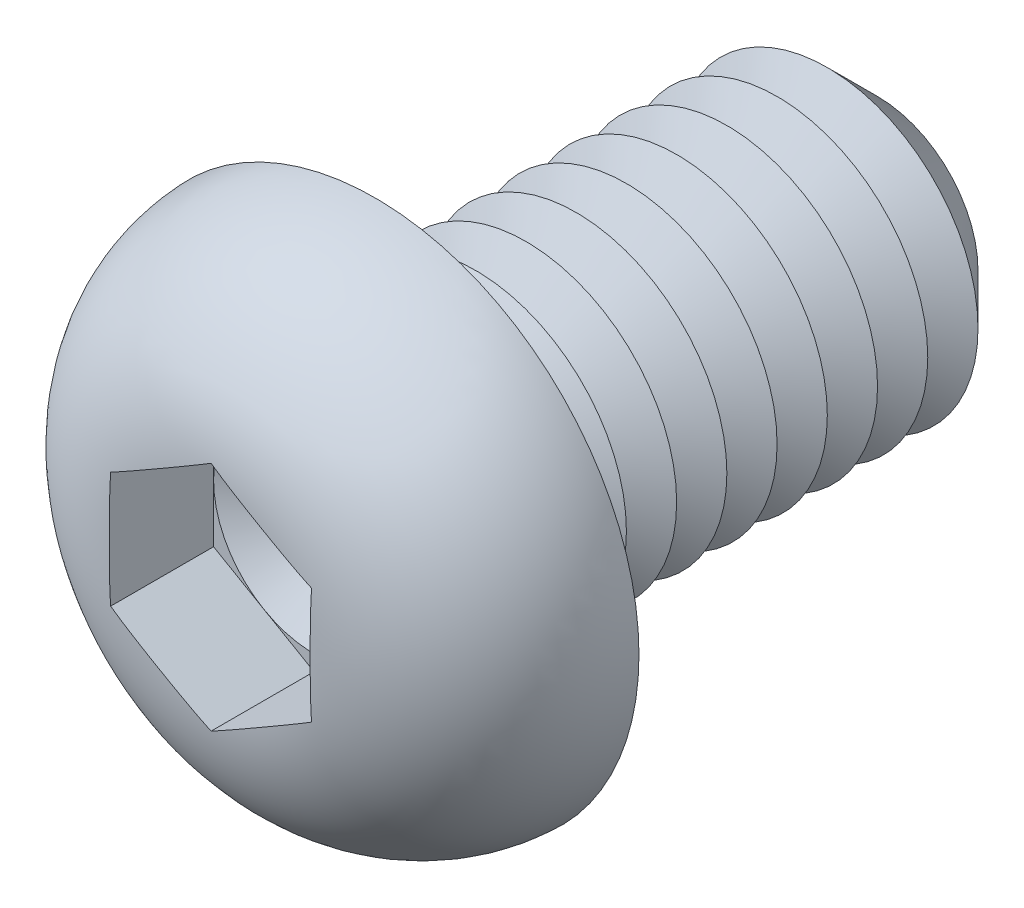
ISO-10303-21;
HEADER;
FILE_DESCRIPTION(('STEP AP214'),'2;1');
FILE_NAME('part.step','',(''),(''),'','','');
FILE_SCHEMA(('AUTOMOTIVE_DESIGN { 1 0 10303 214 1 1 1 1 }'));
ENDSEC;
DATA;
#1=APPLICATION_CONTEXT('core data for automotive mechanical design processes');
#2=APPLICATION_PROTOCOL_DEFINITION('international standard','automotive_design',2000,#1);
#3=PRODUCT_CONTEXT('',#1,'mechanical');
#4=PRODUCT('Part','Part','',(#3));
#5=PRODUCT_RELATED_PRODUCT_CATEGORY('part','',(#4));
#6=PRODUCT_DEFINITION_FORMATION('','',#4);
#7=PRODUCT_DEFINITION_CONTEXT('part definition',#1,'design');
#8=PRODUCT_DEFINITION('design','',#6,#7);
#9=PRODUCT_DEFINITION_SHAPE('','',#8);
#10=(LENGTH_UNIT() NAMED_UNIT(*) SI_UNIT(.MILLI.,.METRE.));
#11=(NAMED_UNIT(*) PLANE_ANGLE_UNIT() SI_UNIT($,.RADIAN.));
#12=(NAMED_UNIT(*) SI_UNIT($,.STERADIAN.) SOLID_ANGLE_UNIT());
#13=UNCERTAINTY_MEASURE_WITH_UNIT(LENGTH_MEASURE(1.E-05),#10,'distance_accuracy_value','');
#14=(GEOMETRIC_REPRESENTATION_CONTEXT(3) GLOBAL_UNCERTAINTY_ASSIGNED_CONTEXT((#13)) GLOBAL_UNIT_ASSIGNED_CONTEXT((#10,
#11,#12)) REPRESENTATION_CONTEXT('',''));
#15=CARTESIAN_POINT('',(0.,0.,0.));
#16=DIRECTION('',(0.,0.,1.));
#17=DIRECTION('',(1.,0.,0.));
#18=AXIS2_PLACEMENT_3D('',#15,#16,#17);
#19=CARTESIAN_POINT('',(0.,0.,1.22));
#20=DIRECTION('',(0.,0.,1.));
#21=DIRECTION('',(1.,0.,0.));
#22=AXIS2_PLACEMENT_3D('',#19,#20,#21);
#23=PLANE('',#22);
#24=CARTESIAN_POINT('',(0.,0.,1.22));
#25=DIRECTION('',(0.,0.,1.));
#26=DIRECTION('',(1.,0.,0.));
#27=AXIS2_PLACEMENT_3D('',#24,#25,#26);
#28=CIRCLE('',#27,2.);
#29=CARTESIAN_POINT('',(2.,0.,1.22));
#30=VERTEX_POINT('',#29);
#31=CARTESIAN_POINT('',(1.,1.73205080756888,1.22));
#32=VERTEX_POINT('',#31);
#33=EDGE_CURVE('E117',#30,#32,#28,.T.);
#34=ORIENTED_EDGE('',*,*,#33,.F.);
#35=DIRECTION('',(0.,1.,0.));
#36=VECTOR('',#35,1.);
#37=CARTESIAN_POINT('',(2.,-1.15470053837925,1.22));
#38=LINE('',#37,#36);
#39=CARTESIAN_POINT('',(2.,1.15470053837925,1.22));
#40=VERTEX_POINT('',#39);
#41=EDGE_CURVE('E140',#30,#40,#38,.T.);
#42=ORIENTED_EDGE('',*,*,#41,.T.);
#43=DIRECTION('',(-0.866025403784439,0.5,0.));
#44=VECTOR('',#43,1.);
#45=CARTESIAN_POINT('',(2.,1.15470053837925,1.22));
#46=LINE('',#45,#44);
#47=EDGE_CURVE('E136',#40,#32,#46,.T.);
#48=ORIENTED_EDGE('',*,*,#47,.T.);
#49=EDGE_LOOP('',(#34,#42,#48));
#50=FACE_BOUND('',#49,.T.);
#51=ADVANCED_FACE('F39',(#50),#23,.T.);
#52=CARTESIAN_POINT('',(0.,0.,1.22));
#53=DIRECTION('',(0.,0.,1.));
#54=DIRECTION('',(1.,0.,0.));
#55=AXIS2_PLACEMENT_3D('',#52,#53,#54);
#56=CIRCLE('',#55,2.);
#57=CARTESIAN_POINT('',(-1.,1.73205080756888,1.22));
#58=VERTEX_POINT('',#57);
#59=EDGE_CURVE('E11',#32,#58,#56,.T.);
#60=ORIENTED_EDGE('',*,*,#59,.F.);
#61=CARTESIAN_POINT('',(0.,2.3094010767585,1.22));
#62=VERTEX_POINT('',#61);
#63=EDGE_CURVE('E130',#32,#62,#46,.T.);
#64=ORIENTED_EDGE('',*,*,#63,.T.);
#65=DIRECTION('',(-0.866025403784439,-0.5,0.));
#66=VECTOR('',#65,1.);
#67=CARTESIAN_POINT('',(0.,2.3094010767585,1.22));
#68=LINE('',#67,#66);
#69=EDGE_CURVE('E131',#62,#58,#68,.T.);
#70=ORIENTED_EDGE('',*,*,#69,.T.);
#71=EDGE_LOOP('',(#60,#64,#70));
#72=FACE_BOUND('',#71,.T.);
#73=ADVANCED_FACE('F129',(#72),#23,.T.);
#74=CARTESIAN_POINT('',(-2.,0.,1.22));
#75=VERTEX_POINT('',#74);
#76=EDGE_CURVE('E49',#58,#75,#56,.T.);
#77=ORIENTED_EDGE('',*,*,#76,.F.);
#78=CARTESIAN_POINT('',(-2.,1.15470053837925,1.22));
#79=VERTEX_POINT('',#78);
#80=EDGE_CURVE('E143',#58,#79,#68,.T.);
#81=ORIENTED_EDGE('',*,*,#80,.T.);
#82=DIRECTION('',(0.,-1.,0.));
#83=VECTOR('',#82,1.);
#84=CARTESIAN_POINT('',(-2.,1.15470053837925,1.22));
#85=LINE('',#84,#83);
#86=EDGE_CURVE('E153',#79,#75,#85,.T.);
#87=ORIENTED_EDGE('',*,*,#86,.T.);
#88=EDGE_LOOP('',(#77,#81,#87));
#89=FACE_BOUND('',#88,.T.);
#90=ADVANCED_FACE('F270',(#89),#23,.T.);
#91=CARTESIAN_POINT('',(-1.,-1.73205080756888,1.22));
#92=VERTEX_POINT('',#91);
#93=EDGE_CURVE('E254',#75,#92,#56,.T.);
#94=ORIENTED_EDGE('',*,*,#93,.F.);
#95=CARTESIAN_POINT('',(-2.,-1.15470053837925,1.22));
#96=VERTEX_POINT('',#95);
#97=EDGE_CURVE('E152',#75,#96,#85,.T.);
#98=ORIENTED_EDGE('',*,*,#97,.T.);
#99=DIRECTION('',(0.866025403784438,-0.5,0.));
#100=VECTOR('',#99,1.);
#101=CARTESIAN_POINT('',(-2.,-1.15470053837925,1.22));
#102=LINE('',#101,#100);
#103=EDGE_CURVE('E158',#96,#92,#102,.T.);
#104=ORIENTED_EDGE('',*,*,#103,.T.);
#105=EDGE_LOOP('',(#94,#98,#104));
#106=FACE_BOUND('',#105,.T.);
#107=ADVANCED_FACE('F265',(#106),#23,.T.);
#108=CARTESIAN_POINT('',(0.999999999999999,-1.73205080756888,1.22));
#109=VERTEX_POINT('',#108);
#110=EDGE_CURVE('E56',#92,#109,#56,.T.);
#111=ORIENTED_EDGE('',*,*,#110,.F.);
#112=CARTESIAN_POINT('',(0.,-2.3094010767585,1.22));
#113=VERTEX_POINT('',#112);
#114=EDGE_CURVE('E157',#92,#113,#102,.T.);
#115=ORIENTED_EDGE('',*,*,#114,.T.);
#116=DIRECTION('',(0.866025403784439,0.5,0.));
#117=VECTOR('',#116,1.);
#118=CARTESIAN_POINT('',(0.,-2.3094010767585,1.22));
#119=LINE('',#118,#117);
#120=EDGE_CURVE('E163',#113,#109,#119,.T.);
#121=ORIENTED_EDGE('',*,*,#120,.T.);
#122=EDGE_LOOP('',(#111,#115,#121));
#123=FACE_BOUND('',#122,.T.);
#124=ADVANCED_FACE('F307',(#123),#23,.T.);
#125=CARTESIAN_POINT('',(0.,0.,-10.));
#126=DIRECTION('',(0.,0.,1.));
#127=DIRECTION('',(1.,0.,0.));
#128=AXIS2_PLACEMENT_3D('',#125,#126,#127);
#129=CYLINDRICAL_SURFACE('',#128,3.);
#130=CARTESIAN_POINT('',(0.,0.,-0.5));
#131=DIRECTION('',(0.,0.,1.));
#132=DIRECTION('',(1.,0.,0.));
#133=AXIS2_PLACEMENT_3D('',#130,#131,#132);
#134=CIRCLE('',#133,3.);
#135=CARTESIAN_POINT('',(3.,0.,-0.5));
#136=VERTEX_POINT('',#135);
#137=EDGE_CURVE('E241',#136,#136,#134,.F.);
#138=ORIENTED_EDGE('',*,*,#137,.T.);
#139=EDGE_LOOP('',(#138));
#140=FACE_BOUND('',#139,.T.);
#141=CARTESIAN_POINT('',(0.,0.,-1.));
#142=DIRECTION('',(0.,0.,1.));
#143=DIRECTION('',(1.,0.,0.));
#144=AXIS2_PLACEMENT_3D('',#141,#142,#143);
#145=CIRCLE('',#144,3.00000000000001);
#146=CARTESIAN_POINT('',(3.00000000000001,0.,-1.));
#147=VERTEX_POINT('',#146);
#148=EDGE_CURVE('E138',#147,#147,#145,.T.);
#149=ORIENTED_EDGE('',*,*,#148,.T.);
#150=EDGE_LOOP('',(#149));
#151=FACE_BOUND('',#150,.T.);
#152=ADVANCED_FACE('F308',(#140,#151),#129,.T.);
#153=CARTESIAN_POINT('',(0.,5.25,0.));
#154=DIRECTION('',(0.,0.,1.));
#155=DIRECTION('',(1.,0.,0.));
#156=AXIS2_PLACEMENT_3D('',#153,#154,#155);
#157=PLANE('',#156);
#158=CARTESIAN_POINT('',(0.,0.,0.));
#159=DIRECTION('',(0.,0.,1.));
#160=DIRECTION('',(1.,0.,0.));
#161=AXIS2_PLACEMENT_3D('',#158,#159,#160);
#162=CIRCLE('',#161,3.5);
#163=CARTESIAN_POINT('',(3.5,0.,0.));
#164=VERTEX_POINT('',#163);
#165=EDGE_CURVE('E244',#164,#164,#162,.T.);
#166=ORIENTED_EDGE('',*,*,#165,.T.);
#167=EDGE_LOOP('',(#166));
#168=FACE_BOUND('',#167,.T.);
#169=CARTESIAN_POINT('',(0.,0.,0.));
#170=DIRECTION('',(0.,0.,1.));
#171=DIRECTION('',(1.,0.,0.));
#172=AXIS2_PLACEMENT_3D('',#169,#170,#171);
#173=CIRCLE('',#172,5.25);
#174=CARTESIAN_POINT('',(5.25,0.,0.));
#175=VERTEX_POINT('',#174);
#176=EDGE_CURVE('E174',#175,#175,#173,.T.);
#177=ORIENTED_EDGE('',*,*,#176,.F.);
#178=EDGE_LOOP('',(#177));
#179=FACE_BOUND('',#178,.T.);
#180=ADVANCED_FACE('F311',(#168,#179),#157,.F.);
#181=CARTESIAN_POINT('',(0.,0.,-0.0999999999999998));
#182=DIRECTION('',(0.,0.,1.));
#183=DIRECTION('',(1.,0.,0.));
#184=AXIS2_PLACEMENT_3D('',#181,#182,#183);
#185=DEGENERATE_TOROIDAL_SURFACE('',#184,1.85147090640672,3.4,.T.);
#186=CARTESIAN_POINT('',(-2.0002,1.15458506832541,3.26900492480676));
#187=CARTESIAN_POINT('',(-1.91694658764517,1.20265144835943,3.27552708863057));
#188=CARTESIAN_POINT('',(-1.83362001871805,1.25076006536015,3.28041849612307));
#189=CARTESIAN_POINT('',(-1.66691146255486,1.34700929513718,3.28784569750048));
#190=CARTESIAN_POINT('',(-1.58352950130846,1.39514989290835,3.29038223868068));
#191=CARTESIAN_POINT('',(-1.4167967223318,1.49141310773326,3.29400753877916));
#192=CARTESIAN_POINT('',(-1.33344591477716,1.5395357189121,3.29509714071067));
#193=CARTESIAN_POINT('',(-1.16673007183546,1.63578915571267,3.29647051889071));
#194=CARTESIAN_POINT('',(-1.08336503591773,1.68391998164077,3.29675420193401));
#195=CARTESIAN_POINT('',(-0.916634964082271,1.78018163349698,3.29675420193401));
#196=CARTESIAN_POINT('',(-0.833269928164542,1.82831245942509,3.29647051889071));
#197=CARTESIAN_POINT('',(-0.666554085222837,1.92456589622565,3.29509714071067));
#198=CARTESIAN_POINT('',(-0.583203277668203,1.9726885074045,3.29400753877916));
#199=CARTESIAN_POINT('',(-0.416470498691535,2.06895172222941,3.29038223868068));
#200=CARTESIAN_POINT('',(-0.333088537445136,2.11709232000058,3.28784569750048));
#201=CARTESIAN_POINT('',(-0.166379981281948,2.21334154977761,3.28041849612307));
#202=CARTESIAN_POINT('',(-0.0830534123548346,2.26145016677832,3.27552708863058));
#203=CARTESIAN_POINT('',(0.000200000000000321,2.30951654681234,3.26900492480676));
#204=B_SPLINE_CURVE_WITH_KNOTS('',3,(#186,#187,#188,#189,#190,#191,#192,#193,#194,#195,#196,
#197,#198,#199,#200,#201,#202,#203),.UNSPECIFIED.,.F.,.F.,(4,2,2,2,2,2,2,2,4),(0.,
0.289010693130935,0.57792963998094,0.866680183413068,1.15546411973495,1.44424805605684,
1.73299859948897,2.02191754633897,2.31092823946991),.UNSPECIFIED.);
#205=CARTESIAN_POINT('',(-2.,1.15470053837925,3.26902062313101));
#206=VERTEX_POINT('',#205);
#207=CARTESIAN_POINT('',(1.70733705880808E-11,2.30940107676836,3.2690206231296));
#208=VERTEX_POINT('',#207);
#209=EDGE_CURVE('E195',#206,#208,#204,.T.);
#210=ORIENTED_EDGE('',*,*,#209,.T.);
#211=CARTESIAN_POINT('',(-0.000199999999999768,2.30951654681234,3.26900492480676));
#212=CARTESIAN_POINT('',(0.0830534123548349,2.26145016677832,3.27552708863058));
#213=CARTESIAN_POINT('',(0.166379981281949,2.21334154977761,3.28041849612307));
#214=CARTESIAN_POINT('',(0.333088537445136,2.11709232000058,3.28784569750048));
#215=CARTESIAN_POINT('',(0.416470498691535,2.06895172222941,3.29038223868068));
#216=CARTESIAN_POINT('',(0.583203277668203,1.9726885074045,3.29400753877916));
#217=CARTESIAN_POINT('',(0.666554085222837,1.92456589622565,3.29509714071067));
#218=CARTESIAN_POINT('',(0.833269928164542,1.82831245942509,3.29647051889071));
#219=CARTESIAN_POINT('',(0.916634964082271,1.78018163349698,3.29675420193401));
#220=CARTESIAN_POINT('',(1.08336503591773,1.68391998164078,3.29675420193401));
#221=CARTESIAN_POINT('',(1.16673007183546,1.63578915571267,3.29647051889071));
#222=CARTESIAN_POINT('',(1.33344591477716,1.5395357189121,3.29509714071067));
#223=CARTESIAN_POINT('',(1.4167967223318,1.49141310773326,3.29400753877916));
#224=CARTESIAN_POINT('',(1.58352950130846,1.39514989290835,3.29038223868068));
#225=CARTESIAN_POINT('',(1.66691146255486,1.34700929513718,3.28784569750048));
#226=CARTESIAN_POINT('',(1.83362001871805,1.25076006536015,3.28041849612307));
#227=CARTESIAN_POINT('',(1.91694658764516,1.20265144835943,3.27552708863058));
#228=CARTESIAN_POINT('',(2.0002,1.15458506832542,3.26900492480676));
#229=B_SPLINE_CURVE_WITH_KNOTS('',3,(#211,#212,#213,#214,#215,#216,#217,#218,#219,#220,#221,
#222,#223,#224,#225,#226,#227,#228),.UNSPECIFIED.,.F.,.F.,(4,2,2,2,2,2,2,2,4),(0.,
0.289010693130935,0.577929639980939,0.866680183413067,1.15546411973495,1.44424805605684,
1.73299859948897,2.02191754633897,2.31092823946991),.UNSPECIFIED.);
#230=CARTESIAN_POINT('',(2.,1.15470053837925,3.26902062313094));
#231=VERTEX_POINT('',#230);
#232=EDGE_CURVE('E224',#208,#231,#229,.T.);
#233=ORIENTED_EDGE('',*,*,#232,.T.);
#234=CARTESIAN_POINT('',(2.,0.,3.29675420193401));
#235=CARTESIAN_POINT('',(2.,-0.0838690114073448,3.29675159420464));
#236=CARTESIAN_POINT('',(2.,-0.167737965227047,3.29653427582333));
#237=CARTESIAN_POINT('',(2.,-0.335473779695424,3.29552217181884));
#238=CARTESIAN_POINT('',(2.,-0.419340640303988,3.29472737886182));
#239=CARTESIAN_POINT('',(2.,-0.587092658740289,3.29218243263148));
#240=CARTESIAN_POINT('',(2.,-0.670977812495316,3.29043194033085));
#241=CARTESIAN_POINT('',(2.,-0.838702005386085,3.28542814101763));
#242=CARTESIAN_POINT('',(2.,-0.922541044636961,3.28217483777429));
#243=CARTESIAN_POINT('',(2.,-1.173343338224,3.26923984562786));
#244=CARTESIAN_POINT('',(2.,-1.34017699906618,3.25638268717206));
#245=CARTESIAN_POINT('',(2.,-1.67225876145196,3.21731215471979));
#246=CARTESIAN_POINT('',(2.,-1.83750825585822,3.19111187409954));
#247=CARTESIAN_POINT('',(2.,-2.10571503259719,3.13417573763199));
#248=CARTESIAN_POINT('',(2.,-2.20973442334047,3.10844622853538));
#249=CARTESIAN_POINT('',(2.,-2.41562153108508,3.04936015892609));
#250=CARTESIAN_POINT('',(2.,-2.51748898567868,3.01600267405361));
#251=CARTESIAN_POINT('',(2.,-2.71832295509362,2.94120377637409));
#252=CARTESIAN_POINT('',(2.,-2.81728700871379,2.89975572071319));
#253=CARTESIAN_POINT('',(2.,-3.01134256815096,2.80859624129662));
#254=CARTESIAN_POINT('',(2.,-3.10643425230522,2.75888519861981));
#255=CARTESIAN_POINT('',(2.,-3.29253530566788,2.65079509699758));
#256=CARTESIAN_POINT('',(2.,-3.38350832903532,2.59235327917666));
#257=CARTESIAN_POINT('',(2.,-3.55964478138,2.46728791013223));
#258=CARTESIAN_POINT('',(2.,-3.64480873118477,2.40066509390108));
#259=CARTESIAN_POINT('',(2.,-3.80840353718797,2.25961603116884));
#260=CARTESIAN_POINT('',(2.,-3.88683504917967,2.18519054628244));
#261=CARTESIAN_POINT('',(2.,-4.03608847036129,2.02906828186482));
#262=CARTESIAN_POINT('',(2.,-4.106911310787,1.94737239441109));
#263=CARTESIAN_POINT('',(2.,-4.23287471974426,1.78665318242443));
#264=CARTESIAN_POINT('',(2.,-4.2888832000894,1.7083085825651));
#265=CARTESIAN_POINT('',(2.,-4.39372062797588,1.54691061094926));
#266=CARTESIAN_POINT('',(2.,-4.44254705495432,1.46385560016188));
#267=CARTESIAN_POINT('',(2.,-4.53249771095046,1.29375158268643));
#268=CARTESIAN_POINT('',(2.,-4.57362814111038,1.20670586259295));
#269=CARTESIAN_POINT('',(2.,-4.6478549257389,1.02924414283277));
#270=CARTESIAN_POINT('',(2.,-4.68094842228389,0.938826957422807));
#271=CARTESIAN_POINT('',(2.,-4.76413649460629,0.674747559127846));
#272=CARTESIAN_POINT('',(2.,-4.80368573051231,0.497625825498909));
#273=CARTESIAN_POINT('',(2.,-4.85179982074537,0.13932226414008));
#274=CARTESIAN_POINT('',(2.,-4.86036774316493,-0.0418591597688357));
#275=CARTESIAN_POINT('',(2.,-4.84642577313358,-0.399473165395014));
#276=CARTESIAN_POINT('',(2.,-4.82452156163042,-0.575929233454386));
#277=CARTESIAN_POINT('',(2.,-4.75142809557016,-0.922615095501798));
#278=CARTESIAN_POINT('',(2.,-4.70024536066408,-1.09284626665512));
#279=CARTESIAN_POINT('',(2.,-4.57020203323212,-1.42258491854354));
#280=CARTESIAN_POINT('',(2.,-4.49131097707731,-1.58208036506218));
#281=CARTESIAN_POINT('',(2.,-4.3083542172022,-1.8860021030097));
#282=CARTESIAN_POINT('',(2.,-4.2042742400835,-2.03041978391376));
#283=CARTESIAN_POINT('',(2.,-3.97174533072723,-2.30354399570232));
#284=CARTESIAN_POINT('',(2.,-3.84281347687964,-2.43183812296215));
#285=CARTESIAN_POINT('',(2.,-3.56631740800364,-2.66612298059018));
#286=CARTESIAN_POINT('',(2.,-3.41877418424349,-2.77213848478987));
#287=CARTESIAN_POINT('',(2.,-3.18261597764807,-2.91604941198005));
#288=CARTESIAN_POINT('',(2.,-3.09905663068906,-2.96247915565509));
#289=CARTESIAN_POINT('',(2.,-2.92856838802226,-3.04879370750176));
#290=CARTESIAN_POINT('',(2.,-2.84163827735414,-3.08867612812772));
#291=CARTESIAN_POINT('',(2.,-2.66495003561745,-3.16199567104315));
#292=CARTESIAN_POINT('',(2.,-2.57518752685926,-3.19542218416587));
#293=CARTESIAN_POINT('',(2.,-2.3936698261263,-3.25594506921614));
#294=CARTESIAN_POINT('',(2.,-2.30191676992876,-3.28304789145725));
#295=CARTESIAN_POINT('',(2.,-2.07265810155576,-3.34285611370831));
#296=CARTESIAN_POINT('',(2.,-1.93423373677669,-3.37205334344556));
#297=CARTESIAN_POINT('',(2.,-1.65546420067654,-3.419280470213));
#298=CARTESIAN_POINT('',(2.,-1.51511762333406,-3.43730169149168));
#299=CARTESIAN_POINT('',(2.,-1.23291689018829,-3.46473877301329));
#300=CARTESIAN_POINT('',(2.,-1.09105869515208,-3.47411015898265));
#301=CARTESIAN_POINT('',(2.,-0.807138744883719,-3.48717303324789));
#302=CARTESIAN_POINT('',(2.,-0.665077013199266,-3.4908651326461));
#303=CARTESIAN_POINT('',(2.,-0.451303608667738,-3.49429675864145));
#304=CARTESIAN_POINT('',(2.,-0.379602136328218,-3.49508825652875));
#305=CARTESIAN_POINT('',(2.,-0.236195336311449,-3.49619580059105));
#306=CARTESIAN_POINT('',(2.,-0.164490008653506,-3.49651184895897));
#307=CARTESIAN_POINT('',(2.,-0.0210718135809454,-3.49680708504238));
#308=CARTESIAN_POINT('',(2.,0.0506410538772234,-3.49678623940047));
#309=CARTESIAN_POINT('',(2.,0.194065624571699,-3.49639104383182));
#310=CARTESIAN_POINT('',(2.,0.265777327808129,-3.49601669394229));
#311=CARTESIAN_POINT('',(2.,0.480501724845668,-3.4941697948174));
#312=CARTESIAN_POINT('',(2.,0.623510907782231,-3.49197539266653));
#313=CARTESIAN_POINT('',(2.,0.909378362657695,-3.48318258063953));
#314=CARTESIAN_POINT('',(2.,1.05223667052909,-3.47658576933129));
#315=CARTESIAN_POINT('',(2.,1.30726724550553,-3.45800282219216));
#316=CARTESIAN_POINT('',(2.,1.41953767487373,-3.44745204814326));
#317=CARTESIAN_POINT('',(2.,1.64336701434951,-3.42020385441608));
#318=CARTESIAN_POINT('',(2.,1.75492585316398,-3.40350582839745));
#319=CARTESIAN_POINT('',(2.,1.97590795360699,-3.36293007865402));
#320=CARTESIAN_POINT('',(2.,2.08534088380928,-3.33910600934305));
#321=CARTESIAN_POINT('',(2.,2.30216001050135,-3.28336687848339));
#322=CARTESIAN_POINT('',(2.,2.40954602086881,-3.25145108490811));
#323=CARTESIAN_POINT('',(2.,2.62289868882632,-3.1784271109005));
#324=CARTESIAN_POINT('',(2.,2.72882262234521,-3.13719314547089));
#325=CARTESIAN_POINT('',(2.,2.93660837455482,-3.04548652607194));
#326=CARTESIAN_POINT('',(2.,3.03847031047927,-2.99501413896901));
#327=CARTESIAN_POINT('',(2.,3.23738754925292,-2.88459171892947));
#328=CARTESIAN_POINT('',(2.,3.33442546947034,-2.82461027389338));
#329=CARTESIAN_POINT('',(2.,3.52225616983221,-2.69545434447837));
#330=CARTESIAN_POINT('',(2.,3.61304636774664,-2.62627609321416));
#331=CARTESIAN_POINT('',(2.,3.77958578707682,-2.48563135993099));
#332=CARTESIAN_POINT('',(2.,3.85595570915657,-2.41489922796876));
#333=CARTESIAN_POINT('',(2.,4.00175744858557,-2.26661746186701));
#334=CARTESIAN_POINT('',(2.,4.07118992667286,-2.18906847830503));
#335=CARTESIAN_POINT('',(2.,4.20228235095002,-2.02784942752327));
#336=CARTESIAN_POINT('',(2.,4.26395450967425,-1.94418931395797));
#337=CARTESIAN_POINT('',(2.,4.37897455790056,-1.7713710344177));
#338=CARTESIAN_POINT('',(2.,4.43232318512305,-1.68221335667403));
#339=CARTESIAN_POINT('',(2.,4.5685109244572,-1.42722170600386));
#340=CARTESIAN_POINT('',(2.,4.64167742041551,-1.25607726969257));
#341=CARTESIAN_POINT('',(2.,4.75695354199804,-0.903699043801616));
#342=CARTESIAN_POINT('',(2.,4.79906366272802,-0.722465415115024));
#343=CARTESIAN_POINT('',(2.,4.84982785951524,-0.362243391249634));
#344=CARTESIAN_POINT('',(2.,4.85966759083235,-0.183422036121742));
#345=CARTESIAN_POINT('',(2.,4.84889099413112,0.17327689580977));
#346=CARTESIAN_POINT('',(2.,4.82827907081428,0.351154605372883));
#347=CARTESIAN_POINT('',(2.,4.75760776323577,0.699332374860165));
#348=CARTESIAN_POINT('',(2.,4.70780624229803,0.869684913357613));
#349=CARTESIAN_POINT('',(2.,4.58058971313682,1.199716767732));
#350=CARTESIAN_POINT('',(2.,4.50317623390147,1.35939667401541));
#351=CARTESIAN_POINT('',(2.,4.32230037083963,1.66542907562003));
#352=CARTESIAN_POINT('',(2.,4.21858077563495,1.81162931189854));
#353=CARTESIAN_POINT('',(2.,3.98879583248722,2.08527000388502));
#354=CARTESIAN_POINT('',(2.,3.86272429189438,2.21270524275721));
#355=CARTESIAN_POINT('',(2.,3.58743550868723,2.45020985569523));
#356=CARTESIAN_POINT('',(2.,3.43756474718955,2.55951924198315));
#357=CARTESIAN_POINT('',(2.,3.12282273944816,2.7535430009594));
#358=CARTESIAN_POINT('',(2.,2.95795742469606,2.83826704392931));
#359=CARTESIAN_POINT('',(2.,2.67096435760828,2.96064273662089));
#360=CARTESIAN_POINT('',(2.,2.55150855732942,3.00473766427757));
#361=CARTESIAN_POINT('',(2.,2.30905936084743,3.08191633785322));
#362=CARTESIAN_POINT('',(2.,2.18606487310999,3.11499664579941));
#363=CARTESIAN_POINT('',(2.,1.93761764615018,3.17114962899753));
#364=CARTESIAN_POINT('',(2.,1.8121607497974,3.19420352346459));
#365=CARTESIAN_POINT('',(2.,1.56000755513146,3.23170431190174));
#366=CARTESIAN_POINT('',(2.,1.43331126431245,3.24615125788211));
#367=CARTESIAN_POINT('',(2.,1.19785080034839,3.26676473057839));
#368=CARTESIAN_POINT('',(2.,1.08915974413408,3.27383022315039));
#369=CARTESIAN_POINT('',(2.,0.87159878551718,3.28448481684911));
#370=CARTESIAN_POINT('',(2.,0.762728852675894,3.28807324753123));
#371=CARTESIAN_POINT('',(2.,0.54488171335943,3.29312180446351));
#372=CARTESIAN_POINT('',(2.,0.435904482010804,3.29458062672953));
#373=CARTESIAN_POINT('',(2.,0.217951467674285,3.29639847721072));
#374=CARTESIAN_POINT('',(2.,0.108975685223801,3.29675759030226));
#375=CARTESIAN_POINT('',(2.,0.,3.29675420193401));
#376=B_SPLINE_CURVE_WITH_KNOTS('',3,(#234,#235,#236,#237,#238,#239,#240,#241,#242,#243,#244,
#245,#246,#247,#248,#249,#250,#251,#252,#253,#254,#255,#256,#257,#258,#259,#260,#261,#262,#263,
#264,#265,#266,#267,#268,#269,#270,#271,#272,#273,#274,#275,#276,#277,#278,#279,#280,#281,#282,
#283,#284,#285,#286,#287,#288,#289,#290,#291,#292,#293,#294,#295,#296,#297,#298,#299,#300,#301,
#302,#303,#304,#305,#306,#307,#308,#309,#310,#311,#312,#313,#314,#315,#316,#317,#318,#319,#320,
#321,#322,#323,#324,#325,#326,#327,#328,#329,#330,#331,#332,#333,#334,#335,#336,#337,#338,#339,
#340,#341,#342,#343,#344,#345,#346,#347,#348,#349,#350,#351,#352,#353,#354,#355,#356,#357,#358,
#359,#360,#361,#362,#363,#364,#365,#366,#367,#368,#369,#370,#371,#372,#373,#374,#375),
.UNSPECIFIED.,.T.,.F.,(4,2,2,2,2,2,2,2,2,2,2,2,2,2,2,2,2,2,2,2,2,2,2,2,2,2,2,2,2,2,2,2,2,2,2,2,
2,2,2,2,2,2,2,2,2,2,2,2,2,2,2,2,2,2,2,2,2,2,2,2,2,2,2,2,2,2,2,2,2,2,4),(0.,0.251606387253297,
0.503215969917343,0.754914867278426,1.00661313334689,1.50825543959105,2.00940643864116,
2.33061510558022,2.65186271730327,2.97337521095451,3.29487288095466,3.61880390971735,
3.94270585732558,4.26657621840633,4.59040689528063,4.8789527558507,5.16759964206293,
5.45601293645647,5.74452864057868,6.28608750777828,6.82759274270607,7.35848716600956,
7.8892634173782,8.42062506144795,8.95228851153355,9.49557283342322,10.0382497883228,
10.3247866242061,10.6114277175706,10.8985359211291,11.1853499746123,11.6091713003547,
12.0333212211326,12.4596400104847,12.8859129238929,13.1010304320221,13.316146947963,
13.5312847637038,13.746422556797,14.1754765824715,14.6043748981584,14.9425387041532,
15.2807358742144,15.6164481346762,15.9521907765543,16.2927694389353,16.6333382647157,
16.9750565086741,17.3169151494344,17.6287548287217,17.9405647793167,18.2518777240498,
18.5631630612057,19.1185081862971,19.6738444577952,20.20853386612,20.7431459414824,
21.2731049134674,21.8030345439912,22.3383600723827,22.8738341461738,23.4279697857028,
23.9818871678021,24.3633752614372,24.7449823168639,25.1273011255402,25.5096176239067,
25.8363061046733,26.163057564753,26.4900090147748,26.8169352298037),.UNSPECIFIED.);
#377=CARTESIAN_POINT('',(2.,-1.15470053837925,3.26902062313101));
#378=VERTEX_POINT('',#377);
#379=EDGE_CURVE('E233',#231,#378,#376,.T.);
#380=ORIENTED_EDGE('',*,*,#379,.T.);
#381=CARTESIAN_POINT('',(2.0002,-1.15458506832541,3.26900492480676));
#382=CARTESIAN_POINT('',(1.91694658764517,-1.20265144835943,3.27552708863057));
#383=CARTESIAN_POINT('',(1.83362001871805,-1.25076006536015,3.28041849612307));
#384=CARTESIAN_POINT('',(1.66691146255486,-1.34700929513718,3.28784569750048));
#385=CARTESIAN_POINT('',(1.58352950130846,-1.39514989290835,3.29038223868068));
#386=CARTESIAN_POINT('',(1.4167967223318,-1.49141310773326,3.29400753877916));
#387=CARTESIAN_POINT('',(1.33344591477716,-1.5395357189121,3.29509714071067));
#388=CARTESIAN_POINT('',(1.16673007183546,-1.63578915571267,3.29647051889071));
#389=CARTESIAN_POINT('',(1.08336503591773,-1.68391998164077,3.29675420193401));
#390=CARTESIAN_POINT('',(0.916634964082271,-1.78018163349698,3.29675420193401));
#391=CARTESIAN_POINT('',(0.833269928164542,-1.82831245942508,3.29647051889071));
#392=CARTESIAN_POINT('',(0.666554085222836,-1.92456589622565,3.29509714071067));
#393=CARTESIAN_POINT('',(0.583203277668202,-1.97268850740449,3.29400753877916));
#394=CARTESIAN_POINT('',(0.416470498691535,-2.06895172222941,3.29038223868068));
#395=CARTESIAN_POINT('',(0.333088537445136,-2.11709232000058,3.28784569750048));
#396=CARTESIAN_POINT('',(0.166379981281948,-2.2133415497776,3.28041849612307));
#397=CARTESIAN_POINT('',(0.0830534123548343,-2.26145016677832,3.27552708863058));
#398=CARTESIAN_POINT('',(-0.000200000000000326,-2.30951654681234,3.26900492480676));
#399=B_SPLINE_CURVE_WITH_KNOTS('',3,(#381,#382,#383,#384,#385,#386,#387,#388,#389,#390,#391,
#392,#393,#394,#395,#396,#397,#398),.UNSPECIFIED.,.F.,.F.,(4,2,2,2,2,2,2,2,4),(0.,
0.289010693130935,0.57792963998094,0.866680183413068,1.15546411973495,1.44424805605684,
1.73299859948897,2.02191754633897,2.31092823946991),.UNSPECIFIED.);
#400=CARTESIAN_POINT('',(0.,-2.3094010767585,3.26902062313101));
#401=VERTEX_POINT('',#400);
#402=EDGE_CURVE('E281',#378,#401,#399,.T.);
#403=ORIENTED_EDGE('',*,*,#402,.T.);
#404=CARTESIAN_POINT('',(0.000199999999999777,-2.30951654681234,3.26900492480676));
#405=CARTESIAN_POINT('',(-0.083053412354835,-2.26145016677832,3.27552708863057));
#406=CARTESIAN_POINT('',(-0.166379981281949,-2.21334154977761,3.28041849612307));
#407=CARTESIAN_POINT('',(-0.333088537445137,-2.11709232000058,3.28784569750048));
#408=CARTESIAN_POINT('',(-0.416470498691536,-2.06895172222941,3.29038223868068));
#409=CARTESIAN_POINT('',(-0.583203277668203,-1.97268850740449,3.29400753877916));
#410=CARTESIAN_POINT('',(-0.666554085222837,-1.92456589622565,3.29509714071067));
#411=CARTESIAN_POINT('',(-0.833269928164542,-1.82831245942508,3.29647051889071));
#412=CARTESIAN_POINT('',(-0.916634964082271,-1.78018163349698,3.29675420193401));
#413=CARTESIAN_POINT('',(-1.08336503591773,-1.68391998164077,3.29675420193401));
#414=CARTESIAN_POINT('',(-1.16673007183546,-1.63578915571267,3.29647051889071));
#415=CARTESIAN_POINT('',(-1.33344591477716,-1.5395357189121,3.29509714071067));
#416=CARTESIAN_POINT('',(-1.4167967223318,-1.49141310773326,3.29400753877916));
#417=CARTESIAN_POINT('',(-1.58352950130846,-1.39514989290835,3.29038223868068));
#418=CARTESIAN_POINT('',(-1.66691146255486,-1.34700929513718,3.28784569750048));
#419=CARTESIAN_POINT('',(-1.83362001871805,-1.25076006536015,3.28041849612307));
#420=CARTESIAN_POINT('',(-1.91694658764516,-1.20265144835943,3.27552708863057));
#421=CARTESIAN_POINT('',(-2.0002,-1.15458506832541,3.26900492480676));
#422=B_SPLINE_CURVE_WITH_KNOTS('',3,(#404,#405,#406,#407,#408,#409,#410,#411,#412,#413,#414,
#415,#416,#417,#418,#419,#420,#421),.UNSPECIFIED.,.F.,.F.,(4,2,2,2,2,2,2,2,4),(0.,
0.289010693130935,0.577929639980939,0.866680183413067,1.15546411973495,1.44424805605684,
1.73299859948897,2.02191754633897,2.31092823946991),.UNSPECIFIED.);
#423=CARTESIAN_POINT('',(-2.,-1.15470053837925,3.26902062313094));
#424=VERTEX_POINT('',#423);
#425=EDGE_CURVE('E277',#401,#424,#422,.T.);
#426=ORIENTED_EDGE('',*,*,#425,.T.);
#427=CARTESIAN_POINT('',(-2.,0.,3.29675420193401));
#428=CARTESIAN_POINT('',(-2.,0.0838690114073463,3.29675159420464));
#429=CARTESIAN_POINT('',(-2.,0.167737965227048,3.29653427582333));
#430=CARTESIAN_POINT('',(-2.,0.335473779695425,3.29552217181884));
#431=CARTESIAN_POINT('',(-2.,0.41934064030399,3.29472737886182));
#432=CARTESIAN_POINT('',(-2.,0.58709265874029,3.29218243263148));
#433=CARTESIAN_POINT('',(-2.,0.670977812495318,3.29043194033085));
#434=CARTESIAN_POINT('',(-2.,0.838702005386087,3.28542814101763));
#435=CARTESIAN_POINT('',(-2.,0.922541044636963,3.28217483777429));
#436=CARTESIAN_POINT('',(-2.,1.173343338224,3.26923984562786));
#437=CARTESIAN_POINT('',(-2.,1.34017699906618,3.25638268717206));
#438=CARTESIAN_POINT('',(-2.,1.67225876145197,3.21731215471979));
#439=CARTESIAN_POINT('',(-2.,1.83750825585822,3.19111187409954));
#440=CARTESIAN_POINT('',(-2.,2.10571503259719,3.13417573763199));
#441=CARTESIAN_POINT('',(-2.,2.20973442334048,3.10844622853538));
#442=CARTESIAN_POINT('',(-2.,2.41562153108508,3.04936015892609));
#443=CARTESIAN_POINT('',(-2.,2.51748898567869,3.01600267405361));
#444=CARTESIAN_POINT('',(-2.,2.71832295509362,2.94120377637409));
#445=CARTESIAN_POINT('',(-2.,2.81728700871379,2.89975572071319));
#446=CARTESIAN_POINT('',(-2.,3.01134256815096,2.80859624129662));
#447=CARTESIAN_POINT('',(-2.,3.10643425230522,2.75888519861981));
#448=CARTESIAN_POINT('',(-2.,3.29253530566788,2.65079509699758));
#449=CARTESIAN_POINT('',(-2.,3.38350832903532,2.59235327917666));
#450=CARTESIAN_POINT('',(-2.,3.55964478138,2.46728791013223));
#451=CARTESIAN_POINT('',(-2.,3.64480873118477,2.40066509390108));
#452=CARTESIAN_POINT('',(-2.,3.80840353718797,2.25961603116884));
#453=CARTESIAN_POINT('',(-2.,3.88683504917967,2.18519054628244));
#454=CARTESIAN_POINT('',(-2.,4.03608847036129,2.02906828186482));
#455=CARTESIAN_POINT('',(-2.,4.106911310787,1.94737239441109));
#456=CARTESIAN_POINT('',(-2.,4.23287471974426,1.78665318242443));
#457=CARTESIAN_POINT('',(-2.,4.2888832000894,1.7083085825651));
#458=CARTESIAN_POINT('',(-2.,4.39372062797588,1.54691061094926));
#459=CARTESIAN_POINT('',(-2.,4.44254705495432,1.46385560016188));
#460=CARTESIAN_POINT('',(-2.,4.53249771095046,1.29375158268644));
#461=CARTESIAN_POINT('',(-2.,4.57362814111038,1.20670586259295));
#462=CARTESIAN_POINT('',(-2.,4.6478549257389,1.02924414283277));
#463=CARTESIAN_POINT('',(-2.,4.68094842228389,0.938826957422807));
#464=CARTESIAN_POINT('',(-2.,4.76413649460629,0.674747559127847));
#465=CARTESIAN_POINT('',(-2.,4.80368573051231,0.497625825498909));
#466=CARTESIAN_POINT('',(-2.,4.85179982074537,0.13932226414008));
#467=CARTESIAN_POINT('',(-2.,4.86036774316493,-0.0418591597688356));
#468=CARTESIAN_POINT('',(-2.,4.84642577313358,-0.399473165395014));
#469=CARTESIAN_POINT('',(-2.,4.82452156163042,-0.575929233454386));
#470=CARTESIAN_POINT('',(-2.,4.75142809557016,-0.922615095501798));
#471=CARTESIAN_POINT('',(-2.,4.70024536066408,-1.09284626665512));
#472=CARTESIAN_POINT('',(-2.,4.57020203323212,-1.42258491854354));
#473=CARTESIAN_POINT('',(-2.,4.49131097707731,-1.58208036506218));
#474=CARTESIAN_POINT('',(-2.,4.3083542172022,-1.8860021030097));
#475=CARTESIAN_POINT('',(-2.,4.2042742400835,-2.03041978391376));
#476=CARTESIAN_POINT('',(-2.,3.97174533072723,-2.30354399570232));
#477=CARTESIAN_POINT('',(-2.,3.84281347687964,-2.43183812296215));
#478=CARTESIAN_POINT('',(-2.,3.56631740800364,-2.66612298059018));
#479=CARTESIAN_POINT('',(-2.,3.41877418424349,-2.77213848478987));
#480=CARTESIAN_POINT('',(-2.,3.18261597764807,-2.91604941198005));
#481=CARTESIAN_POINT('',(-2.,3.09905663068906,-2.96247915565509));
#482=CARTESIAN_POINT('',(-2.,2.92856838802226,-3.04879370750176));
#483=CARTESIAN_POINT('',(-2.,2.84163827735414,-3.08867612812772));
#484=CARTESIAN_POINT('',(-2.,2.66495003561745,-3.16199567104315));
#485=CARTESIAN_POINT('',(-2.,2.57518752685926,-3.19542218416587));
#486=CARTESIAN_POINT('',(-2.,2.3936698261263,-3.25594506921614));
#487=CARTESIAN_POINT('',(-2.,2.30191676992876,-3.28304789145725));
#488=CARTESIAN_POINT('',(-2.,2.07265810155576,-3.34285611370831));
#489=CARTESIAN_POINT('',(-2.,1.93423373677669,-3.37205334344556));
#490=CARTESIAN_POINT('',(-2.,1.65546420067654,-3.419280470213));
#491=CARTESIAN_POINT('',(-2.,1.51511762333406,-3.43730169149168));
#492=CARTESIAN_POINT('',(-2.,1.23291689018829,-3.46473877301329));
#493=CARTESIAN_POINT('',(-2.,1.09105869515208,-3.47411015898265));
#494=CARTESIAN_POINT('',(-2.,0.807138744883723,-3.48717303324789));
#495=CARTESIAN_POINT('',(-2.,0.66507701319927,-3.4908651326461));
#496=CARTESIAN_POINT('',(-2.,0.451303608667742,-3.49429675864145));
#497=CARTESIAN_POINT('',(-2.,0.379602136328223,-3.49508825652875));
#498=CARTESIAN_POINT('',(-2.,0.236195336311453,-3.49619580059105));
#499=CARTESIAN_POINT('',(-2.,0.16449000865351,-3.49651184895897));
#500=CARTESIAN_POINT('',(-2.,0.0210718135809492,-3.49680708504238));
#501=CARTESIAN_POINT('',(-2.,-0.0506410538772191,-3.49678623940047));
#502=CARTESIAN_POINT('',(-2.,-0.194065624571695,-3.49639104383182));
#503=CARTESIAN_POINT('',(-2.,-0.265777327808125,-3.49601669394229));
#504=CARTESIAN_POINT('',(-2.,-0.480501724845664,-3.4941697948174));
#505=CARTESIAN_POINT('',(-2.,-0.623510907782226,-3.49197539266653));
#506=CARTESIAN_POINT('',(-2.,-0.909378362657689,-3.48318258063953));
#507=CARTESIAN_POINT('',(-2.,-1.05223667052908,-3.47658576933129));
#508=CARTESIAN_POINT('',(-2.,-1.30726724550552,-3.45800282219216));
#509=CARTESIAN_POINT('',(-2.,-1.41953767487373,-3.44745204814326));
#510=CARTESIAN_POINT('',(-2.,-1.6433670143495,-3.42020385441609));
#511=CARTESIAN_POINT('',(-2.,-1.75492585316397,-3.40350582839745));
#512=CARTESIAN_POINT('',(-2.,-1.97590795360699,-3.36293007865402));
#513=CARTESIAN_POINT('',(-2.,-2.08534088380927,-3.33910600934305));
#514=CARTESIAN_POINT('',(-2.,-2.30216001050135,-3.28336687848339));
#515=CARTESIAN_POINT('',(-2.,-2.4095460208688,-3.25145108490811));
#516=CARTESIAN_POINT('',(-2.,-2.62289868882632,-3.1784271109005));
#517=CARTESIAN_POINT('',(-2.,-2.72882262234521,-3.13719314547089));
#518=CARTESIAN_POINT('',(-2.,-2.93660837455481,-3.04548652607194));
#519=CARTESIAN_POINT('',(-2.,-3.03847031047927,-2.99501413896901));
#520=CARTESIAN_POINT('',(-2.,-3.23738754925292,-2.88459171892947));
#521=CARTESIAN_POINT('',(-2.,-3.33442546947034,-2.82461027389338));
#522=CARTESIAN_POINT('',(-2.,-3.52225616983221,-2.69545434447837));
#523=CARTESIAN_POINT('',(-2.,-3.61304636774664,-2.62627609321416));
#524=CARTESIAN_POINT('',(-2.,-3.77958578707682,-2.48563135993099));
#525=CARTESIAN_POINT('',(-2.,-3.85595570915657,-2.41489922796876));
#526=CARTESIAN_POINT('',(-2.,-4.00175744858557,-2.26661746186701));
#527=CARTESIAN_POINT('',(-2.,-4.07118992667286,-2.18906847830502));
#528=CARTESIAN_POINT('',(-2.,-4.20228235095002,-2.02784942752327));
#529=CARTESIAN_POINT('',(-2.,-4.26395450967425,-1.94418931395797));
#530=CARTESIAN_POINT('',(-2.,-4.37897455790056,-1.7713710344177));
#531=CARTESIAN_POINT('',(-2.,-4.43232318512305,-1.68221335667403));
#532=CARTESIAN_POINT('',(-2.,-4.5685109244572,-1.42722170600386));
#533=CARTESIAN_POINT('',(-2.,-4.64167742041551,-1.25607726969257));
#534=CARTESIAN_POINT('',(-2.,-4.75695354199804,-0.903699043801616));
#535=CARTESIAN_POINT('',(-2.,-4.79906366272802,-0.722465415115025));
#536=CARTESIAN_POINT('',(-2.,-4.84982785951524,-0.362243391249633));
#537=CARTESIAN_POINT('',(-2.,-4.85966759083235,-0.18342203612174));
#538=CARTESIAN_POINT('',(-2.,-4.84889099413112,0.173276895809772));
#539=CARTESIAN_POINT('',(-2.,-4.82827907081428,0.351154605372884));
#540=CARTESIAN_POINT('',(-2.,-4.75760776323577,0.699332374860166));
#541=CARTESIAN_POINT('',(-2.,-4.70780624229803,0.869684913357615));
#542=CARTESIAN_POINT('',(-2.,-4.58058971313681,1.199716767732));
#543=CARTESIAN_POINT('',(-2.,-4.50317623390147,1.35939667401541));
#544=CARTESIAN_POINT('',(-2.,-4.32230037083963,1.66542907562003));
#545=CARTESIAN_POINT('',(-2.,-4.21858077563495,1.81162931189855));
#546=CARTESIAN_POINT('',(-2.,-3.98879583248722,2.08527000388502));
#547=CARTESIAN_POINT('',(-2.,-3.86272429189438,2.21270524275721));
#548=CARTESIAN_POINT('',(-2.,-3.58743550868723,2.45020985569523));
#549=CARTESIAN_POINT('',(-2.,-3.43756474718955,2.55951924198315));
#550=CARTESIAN_POINT('',(-2.,-3.12282273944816,2.7535430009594));
#551=CARTESIAN_POINT('',(-2.,-2.95795742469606,2.8382670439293));
#552=CARTESIAN_POINT('',(-2.,-2.67096435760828,2.96064273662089));
#553=CARTESIAN_POINT('',(-2.,-2.55150855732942,3.00473766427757));
#554=CARTESIAN_POINT('',(-2.,-2.30905936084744,3.08191633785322));
#555=CARTESIAN_POINT('',(-2.,-2.18606487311,3.11499664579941));
#556=CARTESIAN_POINT('',(-2.,-1.93761764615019,3.17114962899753));
#557=CARTESIAN_POINT('',(-2.,-1.81216074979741,3.19420352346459));
#558=CARTESIAN_POINT('',(-2.,-1.56000755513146,3.23170431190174));
#559=CARTESIAN_POINT('',(-2.,-1.43331126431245,3.24615125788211));
#560=CARTESIAN_POINT('',(-2.,-1.19785080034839,3.26676473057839));
#561=CARTESIAN_POINT('',(-2.,-1.08915974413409,3.27383022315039));
#562=CARTESIAN_POINT('',(-2.,-0.871598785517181,3.28448481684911));
#563=CARTESIAN_POINT('',(-2.,-0.762728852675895,3.28807324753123));
#564=CARTESIAN_POINT('',(-2.,-0.54488171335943,3.29312180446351));
#565=CARTESIAN_POINT('',(-2.,-0.435904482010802,3.29458062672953));
#566=CARTESIAN_POINT('',(-2.,-0.217951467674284,3.29639847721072));
#567=CARTESIAN_POINT('',(-2.,-0.108975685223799,3.29675759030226));
#568=CARTESIAN_POINT('',(-2.,0.,3.29675420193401));
#569=B_SPLINE_CURVE_WITH_KNOTS('',3,(#427,#428,#429,#430,#431,#432,#433,#434,#435,#436,#437,
#438,#439,#440,#441,#442,#443,#444,#445,#446,#447,#448,#449,#450,#451,#452,#453,#454,#455,#456,
#457,#458,#459,#460,#461,#462,#463,#464,#465,#466,#467,#468,#469,#470,#471,#472,#473,#474,#475,
#476,#477,#478,#479,#480,#481,#482,#483,#484,#485,#486,#487,#488,#489,#490,#491,#492,#493,#494,
#495,#496,#497,#498,#499,#500,#501,#502,#503,#504,#505,#506,#507,#508,#509,#510,#511,#512,#513,
#514,#515,#516,#517,#518,#519,#520,#521,#522,#523,#524,#525,#526,#527,#528,#529,#530,#531,#532,
#533,#534,#535,#536,#537,#538,#539,#540,#541,#542,#543,#544,#545,#546,#547,#548,#549,#550,#551,
#552,#553,#554,#555,#556,#557,#558,#559,#560,#561,#562,#563,#564,#565,#566,#567,#568),
.UNSPECIFIED.,.T.,.F.,(4,2,2,2,2,2,2,2,2,2,2,2,2,2,2,2,2,2,2,2,2,2,2,2,2,2,2,2,2,2,2,2,2,2,2,2,
2,2,2,2,2,2,2,2,2,2,2,2,2,2,2,2,2,2,2,2,2,2,2,2,2,2,2,2,2,2,2,2,2,2,4),(0.,0.251606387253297,
0.503215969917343,0.754914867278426,1.0066131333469,1.50825543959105,2.00940643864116,
2.33061510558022,2.65186271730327,2.97337521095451,3.29487288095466,3.61880390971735,
3.94270585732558,4.26657621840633,4.59040689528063,4.8789527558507,5.16759964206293,
5.45601293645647,5.74452864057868,6.28608750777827,6.82759274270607,7.35848716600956,
7.88926341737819,8.42062506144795,8.95228851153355,9.49557283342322,10.0382497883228,
10.3247866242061,10.6114277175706,10.8985359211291,11.1853499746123,11.6091713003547,
12.0333212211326,12.4596400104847,12.8859129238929,13.1010304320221,13.316146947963,
13.5312847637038,13.746422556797,14.1754765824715,14.6043748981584,14.9425387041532,
15.2807358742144,15.6164481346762,15.9521907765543,16.2927694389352,16.6333382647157,
16.9750565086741,17.3169151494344,17.6287548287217,17.9405647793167,18.2518777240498,
18.5631630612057,19.1185081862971,19.6738444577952,20.20853386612,20.7431459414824,
21.2731049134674,21.8030345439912,22.3383600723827,22.8738341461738,23.4279697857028,
23.981887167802,24.3633752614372,24.7449823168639,25.1273011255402,25.5096176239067,
25.8363061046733,26.163057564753,26.4900090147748,26.8169352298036),.UNSPECIFIED.);
#570=EDGE_CURVE('E204',#424,#206,#569,.T.);
#571=ORIENTED_EDGE('',*,*,#570,.T.);
#572=EDGE_LOOP('',(#210,#233,#380,#403,#426,#571));
#573=FACE_BOUND('',#572,.T.);
#574=ORIENTED_EDGE('',*,*,#176,.T.);
#575=EDGE_LOOP('',(#574));
#576=FACE_BOUND('',#575,.T.);
#577=ADVANCED_FACE('F209',(#573,#576),#185,.T.);
#578=CARTESIAN_POINT('',(2.,1.15470053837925,1.22));
#579=DIRECTION('',(0.5,0.866025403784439,0.));
#580=DIRECTION('',(-0.866025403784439,0.5,0.));
#581=AXIS2_PLACEMENT_3D('',#578,#579,#580);
#582=PLANE('',#581);
#583=DIRECTION('',(0.,0.,1.));
#584=VECTOR('',#583,1.);
#585=CARTESIAN_POINT('',(0.,2.3094010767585,1.22));
#586=LINE('',#585,#584);
#587=EDGE_CURVE('E64',#62,#208,#586,.T.);
#588=ORIENTED_EDGE('',*,*,#587,.F.);
#589=ORIENTED_EDGE('',*,*,#63,.F.);
#590=ORIENTED_EDGE('',*,*,#47,.F.);
#591=DIRECTION('',(0.,0.,1.));
#592=VECTOR('',#591,1.);
#593=CARTESIAN_POINT('',(2.,1.15470053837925,1.22));
#594=LINE('',#593,#592);
#595=EDGE_CURVE('E171',#40,#231,#594,.T.);
#596=ORIENTED_EDGE('',*,*,#595,.T.);
#597=ORIENTED_EDGE('',*,*,#232,.F.);
#598=EDGE_LOOP('',(#588,#589,#590,#596,#597));
#599=FACE_BOUND('',#598,.T.);
#600=ADVANCED_FACE('F134',(#599),#582,.F.);
#601=CARTESIAN_POINT('',(2.,-1.15470053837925,1.22));
#602=DIRECTION('',(1.,0.,0.));
#603=DIRECTION('',(0.,1.,0.));
#604=AXIS2_PLACEMENT_3D('',#601,#602,#603);
#605=PLANE('',#604);
#606=ORIENTED_EDGE('',*,*,#595,.F.);
#607=ORIENTED_EDGE('',*,*,#41,.F.);
#608=CARTESIAN_POINT('',(2.,-1.15470053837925,1.22));
#609=VERTEX_POINT('',#608);
#610=EDGE_CURVE('E167',#609,#30,#38,.T.);
#611=ORIENTED_EDGE('',*,*,#610,.F.);
#612=DIRECTION('',(0.,0.,1.));
#613=VECTOR('',#612,1.);
#614=CARTESIAN_POINT('',(2.,-1.15470053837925,1.22));
#615=LINE('',#614,#613);
#616=EDGE_CURVE('E175',#609,#378,#615,.T.);
#617=ORIENTED_EDGE('',*,*,#616,.T.);
#618=ORIENTED_EDGE('',*,*,#379,.F.);
#619=EDGE_LOOP('',(#606,#607,#611,#617,#618));
#620=FACE_BOUND('',#619,.T.);
#621=ADVANCED_FACE('F222',(#620),#605,.F.);
#622=CARTESIAN_POINT('',(0.,-2.3094010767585,1.22));
#623=DIRECTION('',(0.5,-0.866025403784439,0.));
#624=DIRECTION('',(0.866025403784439,0.5,0.));
#625=AXIS2_PLACEMENT_3D('',#622,#623,#624);
#626=PLANE('',#625);
#627=ORIENTED_EDGE('',*,*,#616,.F.);
#628=EDGE_CURVE('E162',#109,#609,#119,.T.);
#629=ORIENTED_EDGE('',*,*,#628,.F.);
#630=ORIENTED_EDGE('',*,*,#120,.F.);
#631=DIRECTION('',(0.,0.,1.));
#632=VECTOR('',#631,1.);
#633=CARTESIAN_POINT('',(0.,-2.3094010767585,1.22));
#634=LINE('',#633,#632);
#635=EDGE_CURVE('E179',#113,#401,#634,.T.);
#636=ORIENTED_EDGE('',*,*,#635,.T.);
#637=ORIENTED_EDGE('',*,*,#402,.F.);
#638=EDGE_LOOP('',(#627,#629,#630,#636,#637));
#639=FACE_BOUND('',#638,.T.);
#640=ADVANCED_FACE('F294',(#639),#626,.F.);
#641=CARTESIAN_POINT('',(-2.,-1.15470053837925,1.22));
#642=DIRECTION('',(-0.5,-0.866025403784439,0.));
#643=DIRECTION('',(0.866025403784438,-0.5,0.));
#644=AXIS2_PLACEMENT_3D('',#641,#642,#643);
#645=PLANE('',#644);
#646=ORIENTED_EDGE('',*,*,#635,.F.);
#647=ORIENTED_EDGE('',*,*,#114,.F.);
#648=ORIENTED_EDGE('',*,*,#103,.F.);
#649=DIRECTION('',(0.,0.,1.));
#650=VECTOR('',#649,1.);
#651=CARTESIAN_POINT('',(-2.,-1.15470053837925,1.22));
#652=LINE('',#651,#650);
#653=EDGE_CURVE('E183',#96,#424,#652,.T.);
#654=ORIENTED_EDGE('',*,*,#653,.T.);
#655=ORIENTED_EDGE('',*,*,#425,.F.);
#656=EDGE_LOOP('',(#646,#647,#648,#654,#655));
#657=FACE_BOUND('',#656,.T.);
#658=ADVANCED_FACE('F291',(#657),#645,.F.);
#659=CARTESIAN_POINT('',(-2.,1.15470053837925,1.22));
#660=DIRECTION('',(-1.,0.,0.));
#661=DIRECTION('',(0.,-1.,0.));
#662=AXIS2_PLACEMENT_3D('',#659,#660,#661);
#663=PLANE('',#662);
#664=ORIENTED_EDGE('',*,*,#653,.F.);
#665=ORIENTED_EDGE('',*,*,#97,.F.);
#666=ORIENTED_EDGE('',*,*,#86,.F.);
#667=DIRECTION('',(0.,0.,1.));
#668=VECTOR('',#667,1.);
#669=CARTESIAN_POINT('',(-2.,1.15470053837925,1.22));
#670=LINE('',#669,#668);
#671=EDGE_CURVE('E187',#79,#206,#670,.T.);
#672=ORIENTED_EDGE('',*,*,#671,.T.);
#673=ORIENTED_EDGE('',*,*,#570,.F.);
#674=EDGE_LOOP('',(#664,#665,#666,#672,#673));
#675=FACE_BOUND('',#674,.T.);
#676=ADVANCED_FACE('F217',(#675),#663,.F.);
#677=CARTESIAN_POINT('',(0.,2.3094010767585,1.22));
#678=DIRECTION('',(-0.5,0.866025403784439,0.));
#679=DIRECTION('',(-0.866025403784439,-0.5,0.));
#680=AXIS2_PLACEMENT_3D('',#677,#678,#679);
#681=PLANE('',#680);
#682=ORIENTED_EDGE('',*,*,#671,.F.);
#683=ORIENTED_EDGE('',*,*,#80,.F.);
#684=ORIENTED_EDGE('',*,*,#69,.F.);
#685=ORIENTED_EDGE('',*,*,#587,.T.);
#686=ORIENTED_EDGE('',*,*,#209,.F.);
#687=EDGE_LOOP('',(#682,#683,#684,#685,#686));
#688=FACE_BOUND('',#687,.T.);
#689=ADVANCED_FACE('F213',(#688),#681,.F.);
#690=EDGE_CURVE('E43',#109,#30,#56,.T.);
#691=ORIENTED_EDGE('',*,*,#690,.F.);
#692=ORIENTED_EDGE('',*,*,#628,.T.);
#693=ORIENTED_EDGE('',*,*,#610,.T.);
#694=EDGE_LOOP('',(#691,#692,#693));
#695=FACE_BOUND('',#694,.T.);
#696=ADVANCED_FACE('F216',(#695),#23,.T.);
#697=CARTESIAN_POINT('',(0.,0.,-1.));
#698=DIRECTION('',(0.,0.,1.));
#699=DIRECTION('',(1.,0.,0.));
#700=AXIS2_PLACEMENT_3D('',#697,#698,#699);
#701=CONICAL_SURFACE('',#700,3.00000000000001,1.0471975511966);
#702=CARTESIAN_POINT('',(0.,0.,-1.5));
#703=DIRECTION('',(0.,0.,1.));
#704=DIRECTION('',(1.,0.,0.));
#705=AXIS2_PLACEMENT_3D('',#702,#703,#704);
#706=CIRCLE('',#705,2.13397459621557);
#707=CARTESIAN_POINT('',(2.13397459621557,0.,-1.5));
#708=VERTEX_POINT('',#707);
#709=EDGE_CURVE('E412',#708,#708,#706,.T.);
#710=ORIENTED_EDGE('',*,*,#709,.T.);
#711=EDGE_LOOP('',(#710));
#712=FACE_BOUND('',#711,.T.);
#713=ORIENTED_EDGE('',*,*,#148,.F.);
#714=EDGE_LOOP('',(#713));
#715=FACE_BOUND('',#714,.T.);
#716=ADVANCED_FACE('F305',(#712,#715),#701,.T.);
#717=CARTESIAN_POINT('',(0.,0.,-1.5));
#718=DIRECTION('',(0.,0.,-1.));
#719=DIRECTION('',(-1.,0.,0.));
#720=AXIS2_PLACEMENT_3D('',#717,#718,#719);
#721=CONICAL_SURFACE('',#720,2.13397459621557,1.0471975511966);
#722=CARTESIAN_POINT('',(0.,0.,-2.));
#723=DIRECTION('',(0.,0.,1.));
#724=DIRECTION('',(1.,0.,0.));
#725=AXIS2_PLACEMENT_3D('',#722,#723,#724);
#726=CIRCLE('',#725,3.00000000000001);
#727=CARTESIAN_POINT('',(3.00000000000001,0.,-2.));
#728=VERTEX_POINT('',#727);
#729=EDGE_CURVE('E460',#728,#728,#726,.T.);
#730=ORIENTED_EDGE('',*,*,#729,.T.);
#731=EDGE_LOOP('',(#730));
#732=FACE_BOUND('',#731,.T.);
#733=ORIENTED_EDGE('',*,*,#709,.F.);
#734=EDGE_LOOP('',(#733));
#735=FACE_BOUND('',#734,.T.);
#736=ADVANCED_FACE('F321',(#732,#735),#721,.T.);
#737=CARTESIAN_POINT('',(0.,0.,-2.));
#738=DIRECTION('',(0.,0.,1.));
#739=DIRECTION('',(1.,0.,0.));
#740=AXIS2_PLACEMENT_3D('',#737,#738,#739);
#741=CONICAL_SURFACE('',#740,3.00000000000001,1.0471975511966);
#742=CARTESIAN_POINT('',(0.,0.,-2.5));
#743=DIRECTION('',(0.,0.,1.));
#744=DIRECTION('',(1.,0.,0.));
#745=AXIS2_PLACEMENT_3D('',#742,#743,#744);
#746=CIRCLE('',#745,2.13397459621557);
#747=CARTESIAN_POINT('',(2.13397459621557,0.,-2.5));
#748=VERTEX_POINT('',#747);
#749=EDGE_CURVE('E457',#748,#748,#746,.T.);
#750=ORIENTED_EDGE('',*,*,#749,.T.);
#751=EDGE_LOOP('',(#750));
#752=FACE_BOUND('',#751,.T.);
#753=ORIENTED_EDGE('',*,*,#729,.F.);
#754=EDGE_LOOP('',(#753));
#755=FACE_BOUND('',#754,.T.);
#756=ADVANCED_FACE('F325',(#752,#755),#741,.T.);
#757=CARTESIAN_POINT('',(0.,0.,-2.5));
#758=DIRECTION('',(0.,0.,-1.));
#759=DIRECTION('',(-1.,0.,0.));
#760=AXIS2_PLACEMENT_3D('',#757,#758,#759);
#761=CONICAL_SURFACE('',#760,2.13397459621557,1.0471975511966);
#762=CARTESIAN_POINT('',(0.,0.,-3.));
#763=DIRECTION('',(0.,0.,1.));
#764=DIRECTION('',(1.,0.,0.));
#765=AXIS2_PLACEMENT_3D('',#762,#763,#764);
#766=CIRCLE('',#765,3.00000000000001);
#767=CARTESIAN_POINT('',(3.00000000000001,0.,-3.));
#768=VERTEX_POINT('',#767);
#769=EDGE_CURVE('E453',#768,#768,#766,.T.);
#770=ORIENTED_EDGE('',*,*,#769,.T.);
#771=EDGE_LOOP('',(#770));
#772=FACE_BOUND('',#771,.T.);
#773=ORIENTED_EDGE('',*,*,#749,.F.);
#774=EDGE_LOOP('',(#773));
#775=FACE_BOUND('',#774,.T.);
#776=ADVANCED_FACE('F329',(#772,#775),#761,.T.);
#777=CARTESIAN_POINT('',(0.,0.,-3.));
#778=DIRECTION('',(0.,0.,1.));
#779=DIRECTION('',(1.,0.,0.));
#780=AXIS2_PLACEMENT_3D('',#777,#778,#779);
#781=CONICAL_SURFACE('',#780,3.00000000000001,1.0471975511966);
#782=CARTESIAN_POINT('',(0.,0.,-3.5));
#783=DIRECTION('',(0.,0.,1.));
#784=DIRECTION('',(1.,0.,0.));
#785=AXIS2_PLACEMENT_3D('',#782,#783,#784);
#786=CIRCLE('',#785,2.13397459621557);
#787=CARTESIAN_POINT('',(2.13397459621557,0.,-3.5));
#788=VERTEX_POINT('',#787);
#789=EDGE_CURVE('E449',#788,#788,#786,.T.);
#790=ORIENTED_EDGE('',*,*,#789,.T.);
#791=EDGE_LOOP('',(#790));
#792=FACE_BOUND('',#791,.T.);
#793=ORIENTED_EDGE('',*,*,#769,.F.);
#794=EDGE_LOOP('',(#793));
#795=FACE_BOUND('',#794,.T.);
#796=ADVANCED_FACE('F333',(#792,#795),#781,.T.);
#797=CARTESIAN_POINT('',(0.,0.,-3.5));
#798=DIRECTION('',(0.,0.,-1.));
#799=DIRECTION('',(-1.,0.,0.));
#800=AXIS2_PLACEMENT_3D('',#797,#798,#799);
#801=CONICAL_SURFACE('',#800,2.13397459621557,1.0471975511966);
#802=CARTESIAN_POINT('',(0.,0.,-4.));
#803=DIRECTION('',(0.,0.,1.));
#804=DIRECTION('',(1.,0.,0.));
#805=AXIS2_PLACEMENT_3D('',#802,#803,#804);
#806=CIRCLE('',#805,3.00000000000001);
#807=CARTESIAN_POINT('',(3.00000000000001,0.,-4.));
#808=VERTEX_POINT('',#807);
#809=EDGE_CURVE('E445',#808,#808,#806,.T.);
#810=ORIENTED_EDGE('',*,*,#809,.T.);
#811=EDGE_LOOP('',(#810));
#812=FACE_BOUND('',#811,.T.);
#813=ORIENTED_EDGE('',*,*,#789,.F.);
#814=EDGE_LOOP('',(#813));
#815=FACE_BOUND('',#814,.T.);
#816=ADVANCED_FACE('F337',(#812,#815),#801,.T.);
#817=CARTESIAN_POINT('',(0.,0.,-4.));
#818=DIRECTION('',(0.,0.,1.));
#819=DIRECTION('',(1.,0.,0.));
#820=AXIS2_PLACEMENT_3D('',#817,#818,#819);
#821=CONICAL_SURFACE('',#820,3.00000000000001,1.0471975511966);
#822=CARTESIAN_POINT('',(0.,0.,-4.5));
#823=DIRECTION('',(0.,0.,1.));
#824=DIRECTION('',(1.,0.,0.));
#825=AXIS2_PLACEMENT_3D('',#822,#823,#824);
#826=CIRCLE('',#825,2.13397459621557);
#827=CARTESIAN_POINT('',(2.13397459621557,0.,-4.5));
#828=VERTEX_POINT('',#827);
#829=EDGE_CURVE('E441',#828,#828,#826,.T.);
#830=ORIENTED_EDGE('',*,*,#829,.T.);
#831=EDGE_LOOP('',(#830));
#832=FACE_BOUND('',#831,.T.);
#833=ORIENTED_EDGE('',*,*,#809,.F.);
#834=EDGE_LOOP('',(#833));
#835=FACE_BOUND('',#834,.T.);
#836=ADVANCED_FACE('F341',(#832,#835),#821,.T.);
#837=CARTESIAN_POINT('',(0.,0.,-4.5));
#838=DIRECTION('',(0.,0.,-1.));
#839=DIRECTION('',(-1.,0.,0.));
#840=AXIS2_PLACEMENT_3D('',#837,#838,#839);
#841=CONICAL_SURFACE('',#840,2.13397459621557,1.0471975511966);
#842=CARTESIAN_POINT('',(0.,0.,-5.));
#843=DIRECTION('',(0.,0.,1.));
#844=DIRECTION('',(1.,0.,0.));
#845=AXIS2_PLACEMENT_3D('',#842,#843,#844);
#846=CIRCLE('',#845,3.00000000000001);
#847=CARTESIAN_POINT('',(3.00000000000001,0.,-5.));
#848=VERTEX_POINT('',#847);
#849=EDGE_CURVE('E438',#848,#848,#846,.T.);
#850=ORIENTED_EDGE('',*,*,#849,.T.);
#851=EDGE_LOOP('',(#850));
#852=FACE_BOUND('',#851,.T.);
#853=ORIENTED_EDGE('',*,*,#829,.F.);
#854=EDGE_LOOP('',(#853));
#855=FACE_BOUND('',#854,.T.);
#856=ADVANCED_FACE('F345',(#852,#855),#841,.T.);
#857=CARTESIAN_POINT('',(0.,0.,-5.));
#858=DIRECTION('',(0.,0.,1.));
#859=DIRECTION('',(1.,0.,0.));
#860=AXIS2_PLACEMENT_3D('',#857,#858,#859);
#861=CONICAL_SURFACE('',#860,3.00000000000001,1.0471975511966);
#862=CARTESIAN_POINT('',(0.,0.,-5.5));
#863=DIRECTION('',(0.,0.,1.));
#864=DIRECTION('',(1.,0.,0.));
#865=AXIS2_PLACEMENT_3D('',#862,#863,#864);
#866=CIRCLE('',#865,2.13397459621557);
#867=CARTESIAN_POINT('',(2.13397459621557,0.,-5.5));
#868=VERTEX_POINT('',#867);
#869=EDGE_CURVE('E434',#868,#868,#866,.T.);
#870=ORIENTED_EDGE('',*,*,#869,.T.);
#871=EDGE_LOOP('',(#870));
#872=FACE_BOUND('',#871,.T.);
#873=ORIENTED_EDGE('',*,*,#849,.F.);
#874=EDGE_LOOP('',(#873));
#875=FACE_BOUND('',#874,.T.);
#876=ADVANCED_FACE('F349',(#872,#875),#861,.T.);
#877=CARTESIAN_POINT('',(0.,0.,-5.5));
#878=DIRECTION('',(0.,0.,-1.));
#879=DIRECTION('',(-1.,0.,0.));
#880=AXIS2_PLACEMENT_3D('',#877,#878,#879);
#881=CONICAL_SURFACE('',#880,2.13397459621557,1.0471975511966);
#882=CARTESIAN_POINT('',(0.,0.,-6.));
#883=DIRECTION('',(0.,0.,1.));
#884=DIRECTION('',(1.,0.,0.));
#885=AXIS2_PLACEMENT_3D('',#882,#883,#884);
#886=CIRCLE('',#885,3.00000000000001);
#887=CARTESIAN_POINT('',(3.00000000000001,0.,-6.));
#888=VERTEX_POINT('',#887);
#889=EDGE_CURVE('E430',#888,#888,#886,.T.);
#890=ORIENTED_EDGE('',*,*,#889,.T.);
#891=EDGE_LOOP('',(#890));
#892=FACE_BOUND('',#891,.T.);
#893=ORIENTED_EDGE('',*,*,#869,.F.);
#894=EDGE_LOOP('',(#893));
#895=FACE_BOUND('',#894,.T.);
#896=ADVANCED_FACE('F353',(#892,#895),#881,.T.);
#897=CARTESIAN_POINT('',(0.,0.,-6.));
#898=DIRECTION('',(0.,0.,1.));
#899=DIRECTION('',(1.,0.,0.));
#900=AXIS2_PLACEMENT_3D('',#897,#898,#899);
#901=CONICAL_SURFACE('',#900,3.00000000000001,1.0471975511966);
#902=CARTESIAN_POINT('',(0.,0.,-6.5));
#903=DIRECTION('',(0.,0.,1.));
#904=DIRECTION('',(1.,0.,0.));
#905=AXIS2_PLACEMENT_3D('',#902,#903,#904);
#906=CIRCLE('',#905,2.13397459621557);
#907=CARTESIAN_POINT('',(2.13397459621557,0.,-6.5));
#908=VERTEX_POINT('',#907);
#909=EDGE_CURVE('E421',#908,#908,#906,.T.);
#910=ORIENTED_EDGE('',*,*,#909,.T.);
#911=EDGE_LOOP('',(#910));
#912=FACE_BOUND('',#911,.T.);
#913=ORIENTED_EDGE('',*,*,#889,.F.);
#914=EDGE_LOOP('',(#913));
#915=FACE_BOUND('',#914,.T.);
#916=ADVANCED_FACE('F357',(#912,#915),#901,.T.);
#917=CARTESIAN_POINT('',(0.,0.,-6.5));
#918=DIRECTION('',(0.,0.,-1.));
#919=DIRECTION('',(-1.,0.,0.));
#920=AXIS2_PLACEMENT_3D('',#917,#918,#919);
#921=CONICAL_SURFACE('',#920,2.13397459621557,1.0471975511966);
#922=CARTESIAN_POINT('',(0.,0.,-7.));
#923=DIRECTION('',(0.,0.,1.));
#924=DIRECTION('',(1.,0.,0.));
#925=AXIS2_PLACEMENT_3D('',#922,#923,#924);
#926=CIRCLE('',#925,3.00000000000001);
#927=CARTESIAN_POINT('',(3.00000000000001,0.,-7.));
#928=VERTEX_POINT('',#927);
#929=EDGE_CURVE('E416',#928,#928,#926,.T.);
#930=ORIENTED_EDGE('',*,*,#929,.T.);
#931=EDGE_LOOP('',(#930));
#932=FACE_BOUND('',#931,.T.);
#933=ORIENTED_EDGE('',*,*,#909,.F.);
#934=EDGE_LOOP('',(#933));
#935=FACE_BOUND('',#934,.T.);
#936=ADVANCED_FACE('F361',(#932,#935),#921,.T.);
#937=CARTESIAN_POINT('',(0.,0.,-7.));
#938=DIRECTION('',(0.,0.,1.));
#939=DIRECTION('',(1.,0.,0.));
#940=AXIS2_PLACEMENT_3D('',#937,#938,#939);
#941=CONICAL_SURFACE('',#940,3.00000000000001,1.0471975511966);
#942=CARTESIAN_POINT('',(0.,0.,-7.5));
#943=DIRECTION('',(0.,0.,1.));
#944=DIRECTION('',(1.,0.,0.));
#945=AXIS2_PLACEMENT_3D('',#942,#943,#944);
#946=CIRCLE('',#945,2.13397459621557);
#947=CARTESIAN_POINT('',(2.13397459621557,0.,-7.5));
#948=VERTEX_POINT('',#947);
#949=EDGE_CURVE('E414',#948,#948,#946,.T.);
#950=ORIENTED_EDGE('',*,*,#949,.T.);
#951=EDGE_LOOP('',(#950));
#952=FACE_BOUND('',#951,.T.);
#953=ORIENTED_EDGE('',*,*,#929,.F.);
#954=EDGE_LOOP('',(#953));
#955=FACE_BOUND('',#954,.T.);
#956=ADVANCED_FACE('F365',(#952,#955),#941,.T.);
#957=CARTESIAN_POINT('',(0.,0.,-7.5));
#958=DIRECTION('',(0.,0.,-1.));
#959=DIRECTION('',(-1.,0.,0.));
#960=AXIS2_PLACEMENT_3D('',#957,#958,#959);
#961=CONICAL_SURFACE('',#960,2.13397459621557,1.0471975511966);
#962=CARTESIAN_POINT('',(0.,0.,-8.));
#963=DIRECTION('',(0.,0.,1.));
#964=DIRECTION('',(1.,0.,0.));
#965=AXIS2_PLACEMENT_3D('',#962,#963,#964);
#966=CIRCLE('',#965,3.00000000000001);
#967=CARTESIAN_POINT('',(3.00000000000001,0.,-8.));
#968=VERTEX_POINT('',#967);
#969=EDGE_CURVE('E409',#968,#968,#966,.T.);
#970=ORIENTED_EDGE('',*,*,#969,.T.);
#971=EDGE_LOOP('',(#970));
#972=FACE_BOUND('',#971,.T.);
#973=ORIENTED_EDGE('',*,*,#949,.F.);
#974=EDGE_LOOP('',(#973));
#975=FACE_BOUND('',#974,.T.);
#976=ADVANCED_FACE('F369',(#972,#975),#961,.T.);
#977=CARTESIAN_POINT('',(0.,0.,-8.));
#978=DIRECTION('',(0.,0.,1.));
#979=DIRECTION('',(1.,0.,0.));
#980=AXIS2_PLACEMENT_3D('',#977,#978,#979);
#981=CONICAL_SURFACE('',#980,3.00000000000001,1.0471975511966);
#982=CARTESIAN_POINT('',(0.,0.,-8.5));
#983=DIRECTION('',(0.,0.,1.));
#984=DIRECTION('',(1.,0.,0.));
#985=AXIS2_PLACEMENT_3D('',#982,#983,#984);
#986=CIRCLE('',#985,2.13397459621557);
#987=CARTESIAN_POINT('',(2.13397459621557,0.,-8.5));
#988=VERTEX_POINT('',#987);
#989=EDGE_CURVE('E124',#988,#988,#986,.T.);
#990=ORIENTED_EDGE('',*,*,#989,.T.);
#991=EDGE_LOOP('',(#990));
#992=FACE_BOUND('',#991,.T.);
#993=ORIENTED_EDGE('',*,*,#969,.F.);
#994=EDGE_LOOP('',(#993));
#995=FACE_BOUND('',#994,.T.);
#996=ADVANCED_FACE('F373',(#992,#995),#981,.T.);
#997=CARTESIAN_POINT('',(0.,0.,-8.5));
#998=DIRECTION('',(0.,0.,-1.));
#999=DIRECTION('',(-1.,0.,0.));
#1000=AXIS2_PLACEMENT_3D('',#997,#998,#999);
#1001=CONICAL_SURFACE('',#1000,2.13397459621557,1.0471975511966);
#1002=CARTESIAN_POINT('',(0.,0.,-9.));
#1003=DIRECTION('',(0.,0.,1.));
#1004=DIRECTION('',(1.,0.,0.));
#1005=AXIS2_PLACEMENT_3D('',#1002,#1003,#1004);
#1006=CIRCLE('',#1005,3.00000000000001);
#1007=CARTESIAN_POINT('',(3.00000000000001,0.,-9.));
#1008=VERTEX_POINT('',#1007);
#1009=EDGE_CURVE('E407',#1008,#1008,#1006,.T.);
#1010=ORIENTED_EDGE('',*,*,#1009,.T.);
#1011=EDGE_LOOP('',(#1010));
#1012=FACE_BOUND('',#1011,.T.);
#1013=ORIENTED_EDGE('',*,*,#989,.F.);
#1014=EDGE_LOOP('',(#1013));
#1015=FACE_BOUND('',#1014,.T.);
#1016=ADVANCED_FACE('F317',(#1012,#1015),#1001,.T.);
#1017=CARTESIAN_POINT('',(0.,0.,-10.));
#1018=DIRECTION('',(0.,0.,-1.));
#1019=DIRECTION('',(-1.,0.,0.));
#1020=AXIS2_PLACEMENT_3D('',#1017,#1018,#1019);
#1021=PLANE('',#1020);
#1022=CARTESIAN_POINT('',(0.,0.,-10.));
#1023=DIRECTION('',(0.,0.,-1.));
#1024=DIRECTION('',(-1.,0.,0.));
#1025=AXIS2_PLACEMENT_3D('',#1022,#1023,#1024);
#1026=CIRCLE('',#1025,2.00000000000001);
#1027=CARTESIAN_POINT('',(-2.00000000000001,0.,-10.));
#1028=VERTEX_POINT('',#1027);
#1029=EDGE_CURVE('E232',#1028,#1028,#1026,.T.);
#1030=ORIENTED_EDGE('',*,*,#1029,.T.);
#1031=EDGE_LOOP('',(#1030));
#1032=FACE_BOUND('',#1031,.T.);
#1033=ADVANCED_FACE('F313',(#1032),#1021,.T.);
#1034=CARTESIAN_POINT('',(0.,0.,-10.));
#1035=DIRECTION('',(0.,0.,1.));
#1036=DIRECTION('',(1.,0.,0.));
#1037=AXIS2_PLACEMENT_3D('',#1034,#1035,#1036);
#1038=CONICAL_SURFACE('',#1037,2.00000000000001,0.785398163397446);
#1039=ORIENTED_EDGE('',*,*,#1009,.F.);
#1040=EDGE_LOOP('',(#1039));
#1041=FACE_BOUND('',#1040,.T.);
#1042=ORIENTED_EDGE('',*,*,#1029,.F.);
#1043=EDGE_LOOP('',(#1042));
#1044=FACE_BOUND('',#1043,.T.);
#1045=ADVANCED_FACE('F316',(#1041,#1044),#1038,.T.);
#1046=CARTESIAN_POINT('',(0.,0.,-0.5));
#1047=DIRECTION('',(0.,0.,1.));
#1048=DIRECTION('',(1.,0.,0.));
#1049=AXIS2_PLACEMENT_3D('',#1046,#1047,#1048);
#1050=TOROIDAL_SURFACE('',#1049,3.5,0.5);
#1051=ORIENTED_EDGE('',*,*,#165,.F.);
#1052=EDGE_LOOP('',(#1051));
#1053=FACE_BOUND('',#1052,.T.);
#1054=ORIENTED_EDGE('',*,*,#137,.F.);
#1055=EDGE_LOOP('',(#1054));
#1056=FACE_BOUND('',#1055,.T.);
#1057=ADVANCED_FACE('F41',(#1053,#1056),#1050,.F.);
#1058=CARTESIAN_POINT('',(0.,0.,1.22));
#1059=DIRECTION('',(0.,0.,1.));
#1060=DIRECTION('',(1.,0.,0.));
#1061=AXIS2_PLACEMENT_3D('',#1058,#1059,#1060);
#1062=CONICAL_SURFACE('',#1061,2.,1.0471975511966);
#1063=CARTESIAN_POINT('',(0.,0.,0.0652994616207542));
#1064=VERTEX_POINT('',#1063);
#1065=VERTEX_LOOP('',#1064);
#1066=FACE_BOUND('',#1065,.T.);
#1067=ORIENTED_EDGE('',*,*,#33,.T.);
#1068=ORIENTED_EDGE('',*,*,#59,.T.);
#1069=ORIENTED_EDGE('',*,*,#76,.T.);
#1070=ORIENTED_EDGE('',*,*,#93,.T.);
#1071=ORIENTED_EDGE('',*,*,#110,.T.);
#1072=ORIENTED_EDGE('',*,*,#690,.T.);
#1073=EDGE_LOOP('',(#1067,#1068,#1069,#1070,#1071,#1072));
#1074=FACE_BOUND('',#1073,.T.);
#1075=ADVANCED_FACE('F113',(#1066,#1074),#1062,.F.);
#1076=CLOSED_SHELL('',(#51,#73,#90,#107,#124,#152,#180,#577,#600,#621,#640,#658,#676,#689,#696,
#716,#736,#756,#776,#796,#816,#836,#856,#876,#896,#916,#936,#956,#976,#996,#1016,#1033,#1045,
#1057,#1075));
#1077=MANIFOLD_SOLID_BREP('B2',#1076);
#1078=ADVANCED_BREP_SHAPE_REPRESENTATION('',(#18,#1077),#14);
#1079=SHAPE_DEFINITION_REPRESENTATION(#9,#1078);
ENDSEC;
END-ISO-10303-21;
